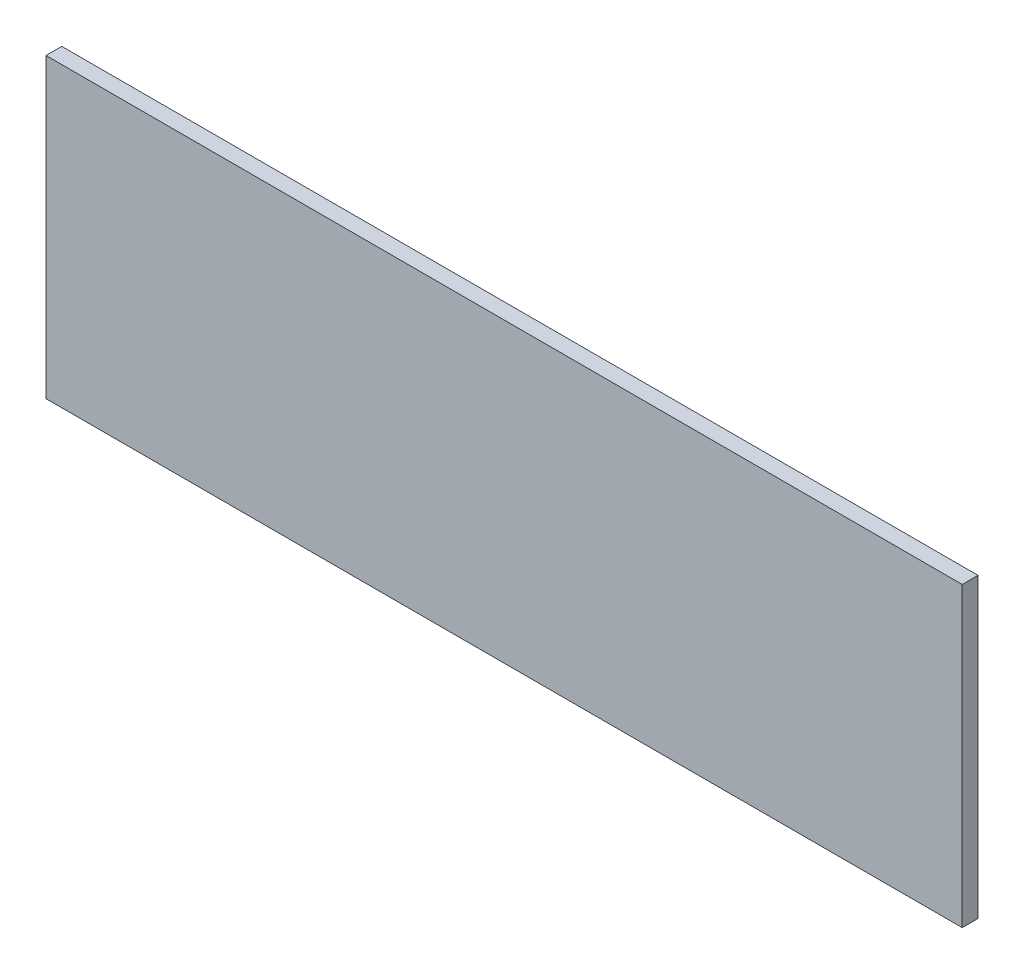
ISO-10303-21;
HEADER;
FILE_DESCRIPTION(('STEP AP214'),'2;1');
FILE_NAME('part.step','',(''),(''),'','','');
FILE_SCHEMA(('AUTOMOTIVE_DESIGN { 1 0 10303 214 1 1 1 1 }'));
ENDSEC;
DATA;
#1=APPLICATION_CONTEXT('core data for automotive mechanical design processes');
#2=APPLICATION_PROTOCOL_DEFINITION('international standard','automotive_design',2000,#1);
#3=PRODUCT_CONTEXT('',#1,'mechanical');
#4=PRODUCT('Part','Part','',(#3));
#5=PRODUCT_RELATED_PRODUCT_CATEGORY('part','',(#4));
#6=PRODUCT_DEFINITION_FORMATION('','',#4);
#7=PRODUCT_DEFINITION_CONTEXT('part definition',#1,'design');
#8=PRODUCT_DEFINITION('design','',#6,#7);
#9=PRODUCT_DEFINITION_SHAPE('','',#8);
#10=(LENGTH_UNIT() NAMED_UNIT(*) SI_UNIT(.MILLI.,.METRE.));
#11=(NAMED_UNIT(*) PLANE_ANGLE_UNIT() SI_UNIT($,.RADIAN.));
#12=(NAMED_UNIT(*) SI_UNIT($,.STERADIAN.) SOLID_ANGLE_UNIT());
#13=UNCERTAINTY_MEASURE_WITH_UNIT(LENGTH_MEASURE(1.E-05),#10,'distance_accuracy_value','');
#14=(GEOMETRIC_REPRESENTATION_CONTEXT(3) GLOBAL_UNCERTAINTY_ASSIGNED_CONTEXT((#13)) GLOBAL_UNIT_ASSIGNED_CONTEXT((#10,
#11,#12)) REPRESENTATION_CONTEXT('',''));
#15=CARTESIAN_POINT('',(0.,0.,0.));
#16=DIRECTION('',(0.,0.,1.));
#17=DIRECTION('',(1.,0.,0.));
#18=AXIS2_PLACEMENT_3D('',#15,#16,#17);
#19=CARTESIAN_POINT('',(474.136881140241,0.,10.));
#20=DIRECTION('',(1.,0.,0.));
#21=DIRECTION('',(0.,0.,-1.));
#22=AXIS2_PLACEMENT_3D('',#19,#20,#21);
#23=PLANE('',#22);
#24=DIRECTION('',(0.,-1.,0.));
#25=VECTOR('',#24,1.);
#26=CARTESIAN_POINT('',(474.136881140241,0.,0.));
#27=LINE('',#26,#25);
#28=CARTESIAN_POINT('',(474.136881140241,-249.252832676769,0.));
#29=VERTEX_POINT('',#28);
#30=CARTESIAN_POINT('',(474.136881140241,-437.402832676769,0.));
#31=VERTEX_POINT('',#30);
#32=EDGE_CURVE('E98',#29,#31,#27,.T.);
#33=ORIENTED_EDGE('',*,*,#32,.F.);
#34=DIRECTION('',(0.,0.,-1.));
#35=VECTOR('',#34,1.);
#36=CARTESIAN_POINT('',(474.136881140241,-249.252832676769,10.));
#37=LINE('',#36,#35);
#38=CARTESIAN_POINT('',(474.136881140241,-249.252832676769,10.));
#39=VERTEX_POINT('',#38);
#40=EDGE_CURVE('E11',#39,#29,#37,.T.);
#41=ORIENTED_EDGE('',*,*,#40,.F.);
#42=DIRECTION('',(0.,-1.,0.));
#43=VECTOR('',#42,1.);
#44=CARTESIAN_POINT('',(474.136881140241,0.,10.));
#45=LINE('',#44,#43);
#46=CARTESIAN_POINT('',(474.136881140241,-437.402832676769,10.));
#47=VERTEX_POINT('',#46);
#48=EDGE_CURVE('E92',#39,#47,#45,.T.);
#49=ORIENTED_EDGE('',*,*,#48,.T.);
#50=DIRECTION('',(0.,0.,-1.));
#51=VECTOR('',#50,1.);
#52=CARTESIAN_POINT('',(474.136881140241,-437.402832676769,10.));
#53=LINE('',#52,#51);
#54=EDGE_CURVE('E73',#47,#31,#53,.T.);
#55=ORIENTED_EDGE('',*,*,#54,.T.);
#56=EDGE_LOOP('',(#33,#41,#49,#55));
#57=FACE_BOUND('',#56,.T.);
#58=ADVANCED_FACE('F35',(#57),#23,.T.);
#59=CARTESIAN_POINT('',(0.,-249.252832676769,10.));
#60=DIRECTION('',(0.,1.,0.));
#61=DIRECTION('',(0.,0.,1.));
#62=AXIS2_PLACEMENT_3D('',#59,#60,#61);
#63=PLANE('',#62);
#64=DIRECTION('',(1.,0.,0.));
#65=VECTOR('',#64,1.);
#66=CARTESIAN_POINT('',(0.,-249.252832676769,0.));
#67=LINE('',#66,#65);
#68=CARTESIAN_POINT('',(-105.863118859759,-249.252832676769,0.));
#69=VERTEX_POINT('',#68);
#70=EDGE_CURVE('E86',#69,#29,#67,.T.);
#71=ORIENTED_EDGE('',*,*,#70,.F.);
#72=DIRECTION('',(0.,0.,-1.));
#73=VECTOR('',#72,1.);
#74=CARTESIAN_POINT('',(-105.863118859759,-249.252832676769,10.));
#75=LINE('',#74,#73);
#76=CARTESIAN_POINT('',(-105.863118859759,-249.252832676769,10.));
#77=VERTEX_POINT('',#76);
#78=EDGE_CURVE('E43',#77,#69,#75,.T.);
#79=ORIENTED_EDGE('',*,*,#78,.F.);
#80=DIRECTION('',(1.,0.,0.));
#81=VECTOR('',#80,1.);
#82=CARTESIAN_POINT('',(0.,-249.252832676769,10.));
#83=LINE('',#82,#81);
#84=EDGE_CURVE('E84',#77,#39,#83,.T.);
#85=ORIENTED_EDGE('',*,*,#84,.T.);
#86=ORIENTED_EDGE('',*,*,#40,.T.);
#87=EDGE_LOOP('',(#71,#79,#85,#86));
#88=FACE_BOUND('',#87,.T.);
#89=ADVANCED_FACE('F82',(#88),#63,.T.);
#90=CARTESIAN_POINT('',(-105.863118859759,0.,10.));
#91=DIRECTION('',(1.,0.,0.));
#92=DIRECTION('',(0.,0.,-1.));
#93=AXIS2_PLACEMENT_3D('',#90,#91,#92);
#94=PLANE('',#93);
#95=DIRECTION('',(0.,-1.,0.));
#96=VECTOR('',#95,1.);
#97=CARTESIAN_POINT('',(-105.863118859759,0.,0.));
#98=LINE('',#97,#96);
#99=CARTESIAN_POINT('',(-105.863118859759,-437.402832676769,0.));
#100=VERTEX_POINT('',#99);
#101=EDGE_CURVE('E66',#69,#100,#98,.T.);
#102=ORIENTED_EDGE('',*,*,#101,.T.);
#103=DIRECTION('',(0.,0.,-1.));
#104=VECTOR('',#103,1.);
#105=CARTESIAN_POINT('',(-105.863118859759,-437.402832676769,10.));
#106=LINE('',#105,#104);
#107=CARTESIAN_POINT('',(-105.863118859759,-437.402832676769,10.));
#108=VERTEX_POINT('',#107);
#109=EDGE_CURVE('E87',#108,#100,#106,.T.);
#110=ORIENTED_EDGE('',*,*,#109,.F.);
#111=DIRECTION('',(0.,-1.,0.));
#112=VECTOR('',#111,1.);
#113=CARTESIAN_POINT('',(-105.863118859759,0.,10.));
#114=LINE('',#113,#112);
#115=EDGE_CURVE('E88',#77,#108,#114,.T.);
#116=ORIENTED_EDGE('',*,*,#115,.F.);
#117=ORIENTED_EDGE('',*,*,#78,.T.);
#118=EDGE_LOOP('',(#102,#110,#116,#117));
#119=FACE_BOUND('',#118,.T.);
#120=ADVANCED_FACE('F89',(#119),#94,.F.);
#121=CARTESIAN_POINT('',(0.,-437.402832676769,10.));
#122=DIRECTION('',(0.,1.,0.));
#123=DIRECTION('',(0.,0.,1.));
#124=AXIS2_PLACEMENT_3D('',#121,#122,#123);
#125=PLANE('',#124);
#126=DIRECTION('',(1.,0.,0.));
#127=VECTOR('',#126,1.);
#128=CARTESIAN_POINT('',(0.,-437.402832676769,0.));
#129=LINE('',#128,#127);
#130=EDGE_CURVE('E94',#100,#31,#129,.T.);
#131=ORIENTED_EDGE('',*,*,#130,.T.);
#132=ORIENTED_EDGE('',*,*,#54,.F.);
#133=DIRECTION('',(1.,0.,0.));
#134=VECTOR('',#133,1.);
#135=CARTESIAN_POINT('',(0.,-437.402832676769,10.));
#136=LINE('',#135,#134);
#137=EDGE_CURVE('E51',#108,#47,#136,.T.);
#138=ORIENTED_EDGE('',*,*,#137,.F.);
#139=ORIENTED_EDGE('',*,*,#109,.T.);
#140=EDGE_LOOP('',(#131,#132,#138,#139));
#141=FACE_BOUND('',#140,.T.);
#142=ADVANCED_FACE('F107',(#141),#125,.F.);
#143=CARTESIAN_POINT('',(0.,0.,10.));
#144=DIRECTION('',(0.,0.,1.));
#145=DIRECTION('',(1.,0.,0.));
#146=AXIS2_PLACEMENT_3D('',#143,#144,#145);
#147=PLANE('',#146);
#148=ORIENTED_EDGE('',*,*,#48,.F.);
#149=ORIENTED_EDGE('',*,*,#84,.F.);
#150=ORIENTED_EDGE('',*,*,#115,.T.);
#151=ORIENTED_EDGE('',*,*,#137,.T.);
#152=EDGE_LOOP('',(#148,#149,#150,#151));
#153=FACE_BOUND('',#152,.T.);
#154=ADVANCED_FACE('F91',(#153),#147,.T.);
#155=CARTESIAN_POINT('',(0.,0.,0.));
#156=DIRECTION('',(0.,0.,1.));
#157=DIRECTION('',(1.,0.,0.));
#158=AXIS2_PLACEMENT_3D('',#155,#156,#157);
#159=PLANE('',#158);
#160=ORIENTED_EDGE('',*,*,#32,.T.);
#161=ORIENTED_EDGE('',*,*,#130,.F.);
#162=ORIENTED_EDGE('',*,*,#101,.F.);
#163=ORIENTED_EDGE('',*,*,#70,.T.);
#164=EDGE_LOOP('',(#160,#161,#162,#163));
#165=FACE_BOUND('',#164,.T.);
#166=ADVANCED_FACE('F109',(#165),#159,.F.);
#167=CLOSED_SHELL('',(#58,#89,#120,#142,#154,#166));
#168=MANIFOLD_SOLID_BREP('B2',#167);
#169=ADVANCED_BREP_SHAPE_REPRESENTATION('',(#18,#168),#14);
#170=SHAPE_DEFINITION_REPRESENTATION(#9,#169);
ENDSEC;
END-ISO-10303-21;
